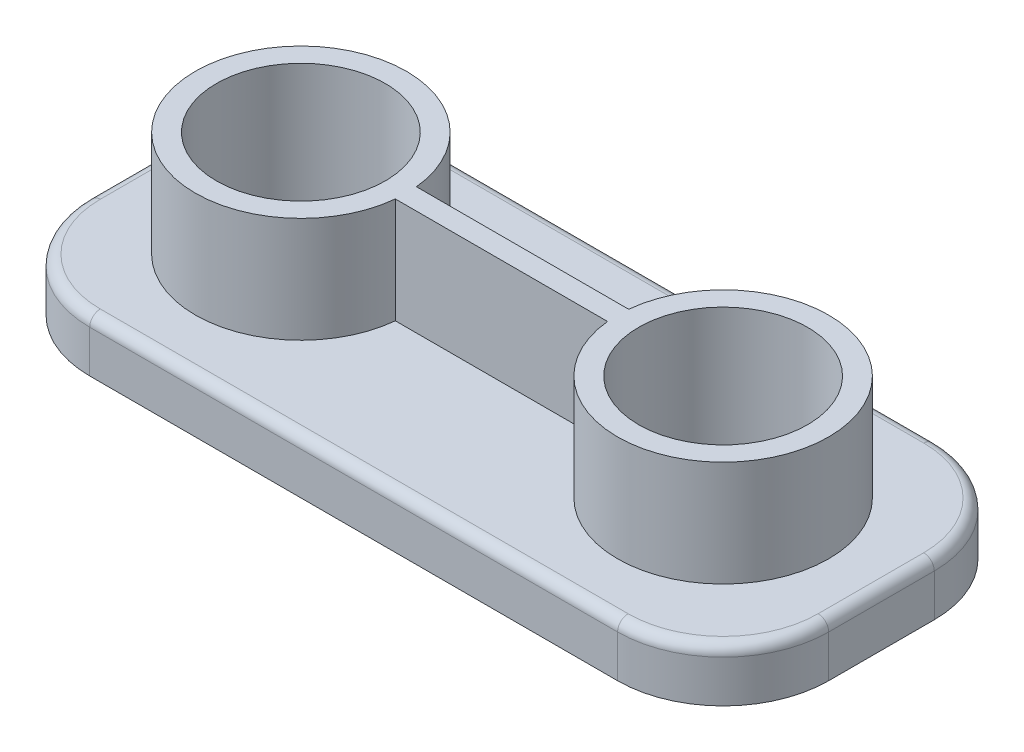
from build123d import *

# Parameters (mm, degrees)
EXTRUDE1_DEPTH     = 12.7
SKETCH2_R          = 25.4
EXTRUDE2_DEPTH     = 25.4
FILLET1_R          = 2.54
SKETCH3_R          = 20.32
CUT_EXTRUDE1_DEPTH = 104.953980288
RIB1_REACH         = 105.954
SKETCH4_WALLS_W    = 260.707960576
SKETCH4_WALLS_H    = 5.08


with BuildPart() as part:
    # Sketch1 → Extrude1 (new body)
    with BuildSketch(Plane(origin=(0, 0, 0), x_dir=(1, 0, 0), z_dir=(0, 1, 0))):
        with BuildLine():
            Line((-63.5, -38.1), (63.5, -38.1))
            ThreePointArc((63.5, -38.1), (81.460512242, -30.660512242), (88.9, -12.7))
            Line((88.9, -12.7), (88.9, 12.7))
            ThreePointArc((88.9, 12.7), (81.460512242, 30.660512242), (63.5, 38.1))
            Line((63.5, 38.1), (-63.5, 38.1))
            ThreePointArc((-63.5, 38.1), (-81.460512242, 30.660512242), (-88.9, 12.7))
            Line((-88.9, 12.7), (-88.9, -12.7))
            ThreePointArc((-88.9, -12.7), (-81.460512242, -30.660512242), (-63.5, -38.1))
        make_face()
    extrude(amount=-EXTRUDE1_DEPTH)

    # Sketch2 → Extrude2 (add)
    with BuildSketch(Plane(origin=(0, 0, 0), x_dir=(-1, 0, 0), z_dir=(0, 1, 0))):
        with Locations(Location((50.8, 0, 0), (0, 0, 270))):
            Circle(SKETCH2_R)
        with Locations(Location((-50.8, 0, 0), (0, 0, 270))):
            Circle(SKETCH2_R)
    extrude(amount=EXTRUDE2_DEPTH)

    # Fillet1
    fillet1_edges = [part.edges().sort_by_distance(p)[0] for p in [
        (0, 0, -38.1),
        (81.460512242, 0, -30.660512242),
        (88.9, 0, 0),
        (81.460512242, 0, 30.660512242),
        (0, 0, 38.1),
        (-81.460512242, 0, 30.660512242),
        (-88.9, 0, 0),
        (-81.460512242, 0, -30.660512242),
    ]]
    fillet(fillet1_edges, radius=FILLET1_R)

    # Sketch3 → Cut-Extrude1 (cut, through all)
    with BuildSketch(Plane(origin=(0, 25.4, 0), x_dir=(-1, 0, 0), z_dir=(0, 1, 0))):
        with Locations(Location((-50.8, 0, 0), (0, 0, 90))):
            Circle(SKETCH3_R)
        with Locations(Location((50.8, 0, 0), (0, 0, 90))):
            Circle(SKETCH3_R)
    extrude(amount=-CUT_EXTRUDE1_DEPTH, mode=Mode.SUBTRACT)

    # Sketch4 walls → Rib1 (add, up to next)
    with BuildSketch(Plane(origin=(0, 25.4, 0), x_dir=(-1, 0, 0), z_dir=(0, 1, 0)), mode=Mode.PRIVATE) as rib1_sk1:
        Rectangle(SKETCH4_WALLS_W, SKETCH4_WALLS_H)
    rib1_tool1 = extrude(rib1_sk1.sketch, amount=-RIB1_REACH, mode=Mode.PRIVATE) - part.part
    add(rib1_tool1.solids().sort_by_distance((0, 25.4, 0))[0])


solid = part.part
